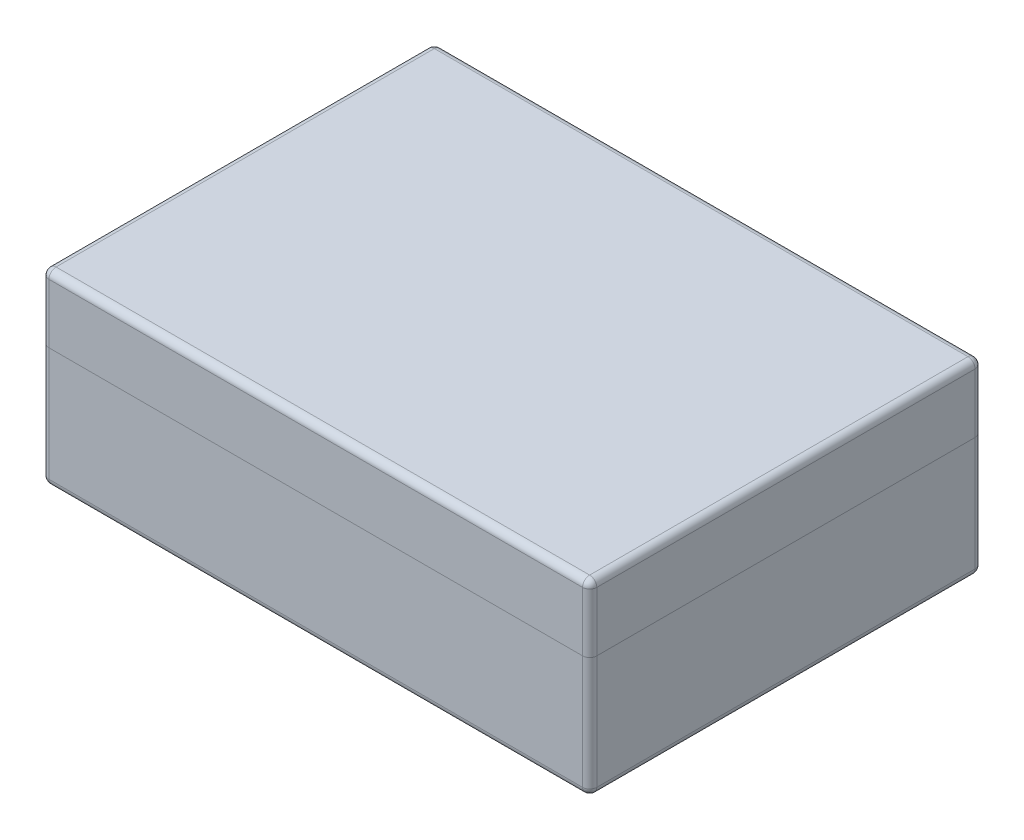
from build123d import *

# Parameters (mm, degrees)
SKETCH1_W                  = 462
SKETCH1_H                  = 331
BOSS_EXTRUDE1_DEPTH        = 158
OUTSIDE_CORNERS_R          = 6
INTERIOR_VOLUME_DEPTH      = 45
INTERIOR_VOLUME_DEPTH_BACK = 94
SKETCH2_W                  = 442
SKETCH2_H                  = 311


with BuildPart() as part:
    # Sketch1 → Boss-Extrude1 (new body)
    with BuildSketch(Plane(origin=(0, 0, 0), x_dir=(1, 0, 0), z_dir=(0, 1, 0))):
        Rectangle(SKETCH1_W, SKETCH1_H)
    extrude(amount=BOSS_EXTRUDE1_DEPTH)

    # outside corners
    outside_corners_edges = [part.edges().sort_by_distance(p)[0] for p in [
        (231, 158, 0),
        (0, 158, -165.5),
        (-231, 158, 0),
        (0, 0, -165.5),
        (231, 0, 0),
        (0, 0, 165.5),
        (-231, 0, 0),
        (-231, 79, -165.5),
        (231, 79, -165.5),
        (231, 79, 165.5),
        (-231, 79, 165.5),
        (0, 158, 165.5),
    ]]
    fillet(outside_corners_edges, radius=OUTSIDE_CORNERS_R)

    # Sketch2 → interior volume (cut, two sides: drawn at the far end of the back side and taken through both)
    with BuildSketch(Plane(origin=(0, 102, 0), x_dir=(1, 0, 0), z_dir=(0, 1, 0)).offset(-INTERIOR_VOLUME_DEPTH_BACK)):
        Rectangle(SKETCH2_W, SKETCH2_H)
    extrude(amount=INTERIOR_VOLUME_DEPTH + INTERIOR_VOLUME_DEPTH_BACK, mode=Mode.SUBTRACT)


with BuildPart() as body_2:
    # top bottom split: the piece on the far side of the plane
    add(part.part)
    split(bisect_by=Plane.ZX.offset(102), keep=Keep.BOTTOM)


with BuildPart() as part_1:
    add(part.part)

    # top bottom split
    split(bisect_by=Plane.ZX.offset(102), keep=Keep.TOP)


solid = Compound([body_2.part, part_1.part])
